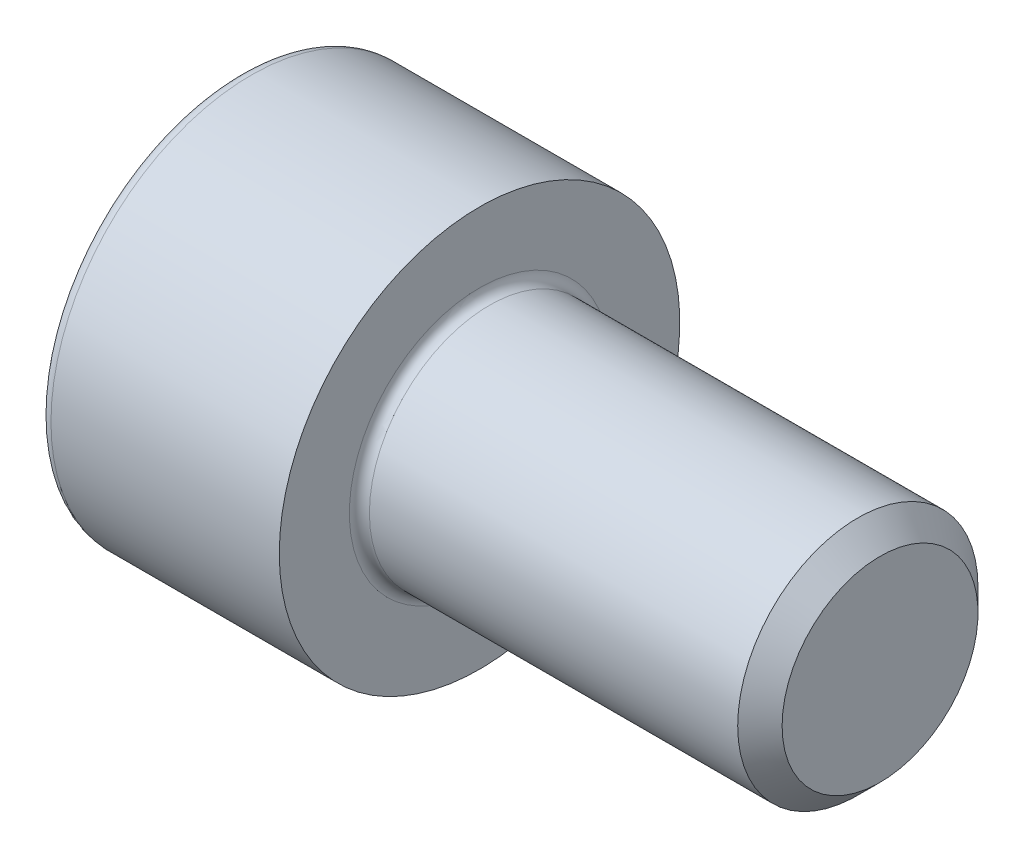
from build123d import *

# Parameters (mm, degrees)
FILLET1_R   = 0.25
FILLET2_R   = 0.3
HEX_2_DEPTH = 3


with BuildPart() as part:
    # BodySke → Base-Revolve (revolve)
    with BuildSketch(Plane.XY, mode=Mode.PRIVATE) as base_revolve_sk:
        Polygon((0, 0), (0, 5), (6, 5), (6, 3), (15.4455, 3), (16, 2.4455), (16, 0), align=None)
    revolve(base_revolve_sk.sketch.rotate(Axis((-31.75, 0, 0), (1, 0, 0)), 90), axis=Axis((-31.75, 0, 0), (1, 0, 0)))

    # Fillet1
    fillet1_edges = [part.edges().sort_by_distance(p)[0] for p in [
        (6, 0, -3),
    ]]
    fillet(fillet1_edges, radius=FILLET1_R)

    # Fillet2
    fillet2_edges = [part.edges().sort_by_distance(p)[0] for p in [
        (0, 0, -5),
    ]]
    fillet(fillet2_edges, radius=FILLET2_R)

    # Sketch2 → Hex-PreBroach (revolve, cut)
    with BuildSketch(Plane.XY, mode=Mode.PRIVATE) as hex_prebroach_sk:
        Polygon((0, 2.542), (3, 2.542), (4.467624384, 0), (0, 0), align=None)
    revolve(hex_prebroach_sk.sketch.rotate(Axis((0, 0, 0), (1, 0, 0)), 90), axis=Axis((0, 0, 0), (1, 0, 0)), mode=Mode.SUBTRACT)

    # Sketch3 → Hex 2 (cut)
    with BuildSketch(Plane(origin=(0, 0, 0), x_dir=(0, 0.500000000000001, 0.866025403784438), z_dir=(-1, 0, 0))):
        Polygon((1.467624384, 2.542), (-1.467624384, 2.542), (-2.935248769, 0), (-1.467624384, -2.542), (1.467624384, -2.542), (2.935248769, 0), align=None)
    extrude(amount=-HEX_2_DEPTH, mode=Mode.SUBTRACT)


solid = part.part
